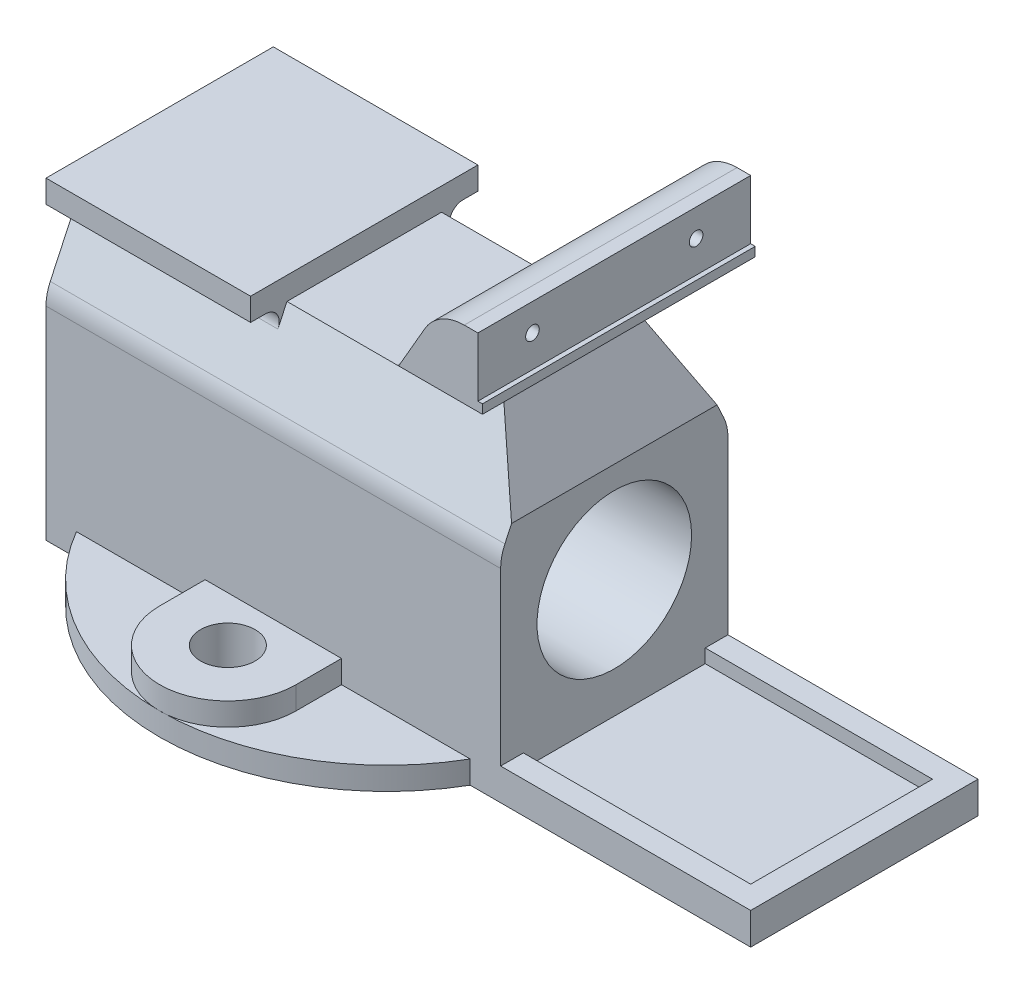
from build123d import *

# Parameters (mm, degrees)
SKETCH17_R          = 50
BOSS_EXTRUDE9_DEPTH = 5
BOSS_EXTRUDE1_DEPTH = 5
SKETCH3_R           = 5.999999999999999
CUT_EXTRUDE1_DEPTH  = 72.4142842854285
BOSS_EXTRUDE3_DEPTH = 50
BOSS_EXTRUDE7_DEPTH = 45
BOSS_EXTRUDE4_DEPTH = 50
BOSS_EXTRUDE5_DEPTH = 30
CUT_EXTRUDE2_DEPTH  = 161.90059042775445
CUT_EXTRUDE4_REACH  = 146.79
SKETCH12_W          = 60.00000000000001
SKETCH12_H          = 2
BOSS_EXTRUDE6_DEPTH = 1
SKETCH14_R          = 17
CUT_EXTRUDE7_DEPTH  = 145.7895023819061
SKETCH15_R          = 1.5000000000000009
CUT_EXTRUDE8_DEPTH  = 5
CUT_EXTRUDE9_DEPTH  = 3
FILLET1_R           = 10
SKETCH19_R          = 2.5000000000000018
SKETCH19_R_2        = 2.500000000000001
CUT_EXTRUDE10_DEPTH = 10


with BuildPart() as part:
    # Sketch17 → Boss-Extrude9 (new body)
    with BuildSketch(Plane(origin=(0, 0, 0), x_dir=(1, 0, 0), z_dir=(0, 1, 0))):
        with Locations(Location((0, 0, 0), (0, 0, 270))):
            Circle(SKETCH17_R)
    extrude(amount=BOSS_EXTRUDE9_DEPTH)

    # Sketch2 → Boss-Extrude1 (add)
    with BuildSketch(Plane.XZ.offset(-5)):
        with BuildLine():
            Line((-14.999999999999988, -35), (-15, 35))
            ThreePointArc((-15, 35), (9.2e-16, 49.99999999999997), (14.999999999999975, 35))
            Line((14.999999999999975, 35), (14.999999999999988, -35))
            ThreePointArc((14.999999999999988, -35), (1.01e-14, -50), (-14.999999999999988, -35))
        make_face()
    extrude(amount=-BOSS_EXTRUDE1_DEPTH)

    # Sketch3 → Cut-Extrude1 (cut, through all)
    with BuildSketch(Plane(origin=(0, 10, 0), x_dir=(1, 0, 0), z_dir=(0, 1, 0))):
        with Locations(Location((1.286e-14, 35, 0), (0, 0, 270))):
            Circle(SKETCH3_R)
        with Locations(Location((0, -35, 0), (0, 0, 270))):
            Circle(SKETCH3_R)
    extrude(amount=-CUT_EXTRUDE1_DEPTH, mode=Mode.SUBTRACT)

    # Sketch5 → Boss-Extrude3 (add, symmetric)
    with BuildSketch(Plane(origin=(0, 0, 0), x_dir=(0, 0, -1), z_dir=(1, 0, 0))):
        with BuildLine():
            Line((17, 63.999999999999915), (-17, 63.999999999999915))
            Line((-17, 63.999999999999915), (-24.063077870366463, 48.85318062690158))
            ThreePointArc((-24.063077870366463, 48.85318062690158), (-24.76296007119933, 46.79139414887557), (-25.000000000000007, 44.626998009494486))
            Line((-25.000000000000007, 44.626998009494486), (-25, 0))
            Line((-25, 0), (25, 0))
            Line((25, 0), (25.000000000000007, 44.626998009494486))
            ThreePointArc((25.000000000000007, 44.626998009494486), (24.76296007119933, 46.79139414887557), (24.063077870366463, 48.85318062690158))
            Line((24.063077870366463, 48.85318062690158), (17, 63.999999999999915))
        make_face()
    extrude(amount=BOSS_EXTRUDE3_DEPTH, both=True)

    # Sketch4 → Boss-Extrude7 (add)
    with BuildSketch(Plane(origin=(-50, 0, 0), x_dir=(0, 0, -1), z_dir=(1, 0, 0))):
        with BuildLine():
            Line((-17, 63.999999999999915), (-18.9901333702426, 59.73214521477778))
            ThreePointArc((-18.9901333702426, 59.73214521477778), (-19.178882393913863, 62.61189882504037), (-21.709056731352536, 63.999999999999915))
            Line((-21.709056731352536, 63.999999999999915), (-24.999999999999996, 63.999999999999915))
            Line((-24.999999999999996, 63.999999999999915), (-25, 68.99999999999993))
            Line((-25, 68.99999999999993), (25, 68.99999999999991))
            Line((25, 68.99999999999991), (24.999999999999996, 63.999999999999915))
            Line((24.999999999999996, 63.999999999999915), (21.709056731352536, 63.999999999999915))
            ThreePointArc((21.709056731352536, 63.999999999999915), (19.178882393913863, 62.61189882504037), (18.990133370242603, 59.73214521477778))
            Line((18.990133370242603, 59.73214521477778), (17, 63.999999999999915))
            Line((17, 63.999999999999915), (-17, 63.999999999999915))
        make_face()
    extrude(amount=BOSS_EXTRUDE7_DEPTH)

    # Sketch6 → Boss-Extrude4 (add)
    with BuildSketch(Plane.XY.offset(25)):
        Polygon((50, 6.999999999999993), (50, 0), (105, 1.73e-15), (105, 7.000000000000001), align=None)
    extrude(amount=-BOSS_EXTRUDE4_DEPTH)

    # Sketch7 → Boss-Extrude5 (add, symmetric)
    with BuildSketch(Plane.XY):
        with BuildLine():
            Line((50, 63.999999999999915), (50, 91.99999999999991))
            Line((50, 91.99999999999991), (47, 91.99999999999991))
            ThreePointArc((47, 91.99999999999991), (41.999999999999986, 90.66025403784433), (38.3397459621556, 86.99999999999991))
            Line((38.3397459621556, 86.99999999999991), (25.060689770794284, 63.999999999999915))
            Line((25.060689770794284, 63.999999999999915), (50, 63.999999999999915))
        make_face()
    extrude(amount=BOSS_EXTRUDE5_DEPTH, both=True)

    # Sketch8 → Cut-Extrude2 (cut, through all)
    with BuildSketch(Plane.XY.offset(30)):
        with BuildLine():
            Line((50, 51.99999999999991), (50, 76.99999999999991))
            Line((50, 76.99999999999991), (44.22649730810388, 76.99999999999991))
            ThreePointArc((44.22649730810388, 76.99999999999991), (39.89637028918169, 74.49999999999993), (39.896370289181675, 69.49999999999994))
            Line((39.896370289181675, 69.49999999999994), (50, 51.99999999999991))
        make_face()
    extrude(amount=-CUT_EXTRUDE2_DEPTH, mode=Mode.SUBTRACT)

    # Sketch10 → Cut-Extrude4 (cut, up to next)
    with BuildSketch(Plane(origin=(50, 0, 0), x_dir=(0, 0, -1), z_dir=(1, 0, 0)), mode=Mode.PRIVATE) as cut_extrude4_sk1:
        with BuildLine():
            Line((30, 76.99999999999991), (30.000000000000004, 36.121410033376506))
            Line((30.000000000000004, 36.121410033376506), (15.581644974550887, 67.04167216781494))
            ThreePointArc((15.581644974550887, 67.04167216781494), (16.022059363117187, 73.76109725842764), (21.9257994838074, 76.9999999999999))
            Line((21.9257994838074, 76.9999999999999), (30, 76.99999999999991))
        make_face()
    cut_extrude4_tool1 = extrude(cut_extrude4_sk1.sketch, amount=-CUT_EXTRUDE4_REACH, mode=Mode.PRIVATE) & part.part
    # Sketch10 → Cut-Extrude4 (cut, up to next)
    with BuildSketch(Plane(origin=(50, 0, 0), x_dir=(0, 0, -1), z_dir=(1, 0, 0)), mode=Mode.PRIVATE) as cut_extrude4_sk2:
        with BuildLine():
            Line((-30, 76.99999999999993), (-21.9257994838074, 76.9999999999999))
            ThreePointArc((-21.9257994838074, 76.9999999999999), (-16.022059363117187, 73.76109725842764), (-15.581644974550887, 67.04167216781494))
            Line((-15.581644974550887, 67.04167216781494), (-30.000000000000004, 36.121410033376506))
            Line((-30.000000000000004, 36.121410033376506), (-30, 76.99999999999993))
        make_face()
    cut_extrude4_tool2 = extrude(cut_extrude4_sk2.sketch, amount=-CUT_EXTRUDE4_REACH, mode=Mode.PRIVATE) & part.part
    add(cut_extrude4_tool1.solids().sort_by_distance((50, 62.513097, -24.331596))[0], mode=Mode.SUBTRACT)
    add(cut_extrude4_tool2.solids().sort_by_distance((50, 62.513097, 24.331596))[0], mode=Mode.SUBTRACT)

    # Sketch12 → Boss-Extrude6 (add)
    with BuildSketch(Plane(origin=(50, 0, 0), x_dir=(0, 0, -1), z_dir=(1, 0, 0))):
        with Locations((0, 77.99999999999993)):
            Rectangle(SKETCH12_W, SKETCH12_H)
    extrude(amount=BOSS_EXTRUDE6_DEPTH)

    # Sketch14 → Cut-Extrude7 (cut, through all)
    with BuildSketch(Plane(origin=(50, 0, 0), x_dir=(0, 0, -1), z_dir=(1, 0, 0))):
        with Locations((0, 30)):
            Circle(SKETCH14_R)
    extrude(amount=-CUT_EXTRUDE7_DEPTH, mode=Mode.SUBTRACT)

    # Sketch15 → Cut-Extrude8 (cut)
    with BuildSketch(Plane(origin=(50, 0, 0), x_dir=(0, 0, -1), z_dir=(1, 0, 0))):
        with Locations((-18, 85.99999999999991)):
            Circle(SKETCH15_R)
        with Locations(Location((18, 85.99999999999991, 0), (0, 0, 180))):
            Circle(SKETCH15_R)
    extrude(amount=-CUT_EXTRUDE8_DEPTH, mode=Mode.SUBTRACT)

    # Sketch18 → Cut-Extrude9 (cut)
    with BuildSketch(Plane(origin=(-9.9e-16, 6.999999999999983, 0), x_dir=(1, 1.4e-16, 0), z_dir=(-1.4e-16, 1, 0))):
        Polygon((50, 20), (50, -20), (99.99999999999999, -20), (99.99999999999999, 20.000000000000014), align=None)
    extrude(amount=-CUT_EXTRUDE9_DEPTH, mode=Mode.SUBTRACT)

    # Fillet1
    fillet1_edges = [part.edges().sort_by_distance(p)[0] for p in [
        (25.060689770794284, 63.999999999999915, 0),
    ]]
    fillet(fillet1_edges, radius=FILLET1_R)

    # Sketch19 → Cut-Extrude10 (cut)
    with BuildSketch(Plane.ZY.offset(50)):
        with Locations((0, 52.5)):
            Circle(SKETCH19_R)
        with Locations((0, 7.5)):
            Circle(SKETCH19_R_2)
    extrude(amount=-CUT_EXTRUDE10_DEPTH, mode=Mode.SUBTRACT)


solid = part.part
